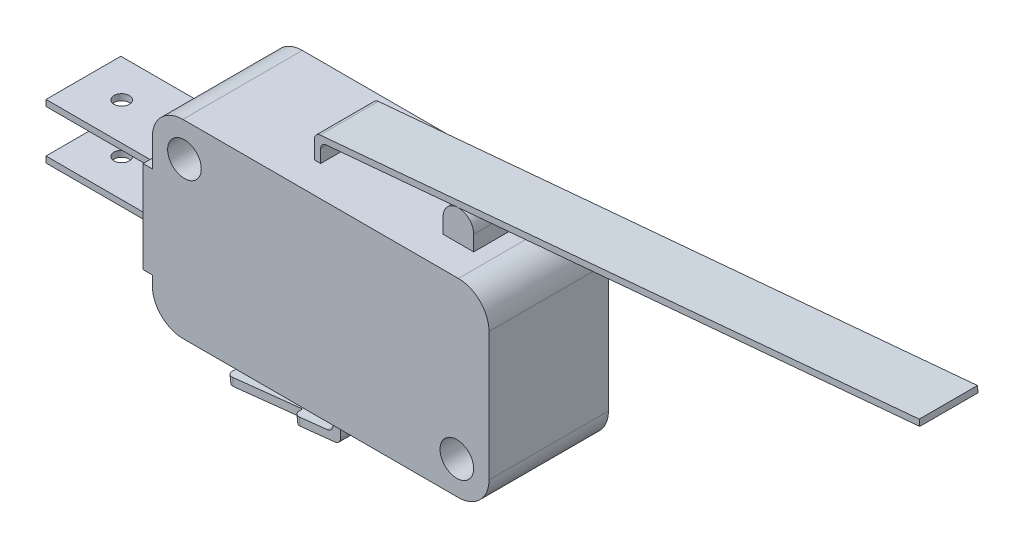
from build123d import *

# Parameters (mm, degrees)
SKETCH1_R      = 1.395
EXTRUDE1_DEPTH = 4.955
SKETCH2_W      = 9.906
SKETCH2_H      = 0.508
EXTRUDE2_DEPTH = 3.105
EXTRUDE3_DEPTH = 2.415
EXTRUDE4_DEPTH = 2.92
EXTRUDE5_REACH = 54.668
SKETCH5_W      = 6.351205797
SKETCH5_H      = 0.762
SKETCH5_H_2    = 0.76
EXTRUDE6_REACH = 54.668
FILLET1_R      = 0.508
EXTRUDE7_REACH = 52.435
SKETCH6_R      = 0.635
SKETCH_2_R     = 1.395
EXTRUDE8_DEPTH = 7.92


with BuildPart() as part:
    # Sketch1 → Extrude1 (new, symmetric)
    # profile 1 of 3: a face of its own
    with BuildSketch(Plane.XY):
        with BuildLine():
            Line((13.97, -5.334), (13.97, 5.334))
            ThreePointArc((13.97, 5.334), (13.226051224, 7.130051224), (11.43, 7.874))
            Line((11.43, 7.874), (-11.43, 7.874))
            ThreePointArc((-11.43, 7.874), (-13.226051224, 7.130051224), (-13.97, 5.334))
            Line((-13.97, 5.334), (-13.97, 3.048))
            Line((-13.97, 3.048), (-14.732, 3.048))
            Line((-14.732, 3.048), (-14.732, -4.572))
            Line((-14.732, -4.572), (-13.97, -4.572))
            Line((-13.97, -4.572), (-13.97, -5.334))
            ThreePointArc((-13.97, -5.334), (-13.226051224, -7.130051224), (-11.43, -7.874))
            Line((-11.43, -7.874), (11.43, -7.874))
            ThreePointArc((11.43, -7.874), (13.226051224, -7.130051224), (13.97, -5.334))
        make_face()
        with Locations((11.3, -5.16)):
            Circle(SKETCH1_R, mode=Mode.SUBTRACT)
        with Locations((-11.3, 5.08)):
            Circle(SKETCH1_R, mode=Mode.SUBTRACT)
    # profile 2 of 3: a face of its own
    with BuildSketch(Plane.XY):
        with Locations((-11.3, 5.08)):
            Circle(SKETCH1_R)
    # profile 3 of 3: a face of its own
    with BuildSketch(Plane.XY):
        with Locations((11.3, -5.16)):
            Circle(SKETCH1_R)
    extrude(amount=EXTRUDE1_DEPTH, both=True)

    # Sketch2 → Extrude2 (add, symmetric)
    with BuildSketch(Plane.XY):
        with Locations((-19.685, -2.54)):
            Rectangle(SKETCH2_W, SKETCH2_H)
        with Locations((-19.685, 1.524)):
            Rectangle(SKETCH2_W, SKETCH2_H)
    extrude(amount=EXTRUDE2_DEPTH, both=True)

    # Sketch3 → Extrude3 (add, symmetric)
    with BuildSketch(Plane.XY):
        Polygon((47.128347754, 14.344963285), (-3.048, 9.862642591), (-3.048, 7.874), (-2.54, 7.874), (-2.54, 9.398), (47.173548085, 13.838978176), align=None)
        with BuildLine():
            Line((10.16, 7.874), (10.16, 9.139))
            ThreePointArc((10.16, 9.139), (8.89, 10.409), (7.62, 9.139))
            Line((7.62, 9.139), (7.62, 7.874))
            Line((7.62, 7.874), (10.16, 7.874))
        make_face()
    extrude(amount=EXTRUDE3_DEPTH, both=True)

    # Sketch4 → Extrude4 (add, symmetric)
    with BuildSketch(Plane.XY):
        Polygon((-0.38, -10.984), (-0.38, -7.874), (-1.015, -7.874), (-1.015, -10.414), (-10.612457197, -11.452431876), (-10.54414973, -12.083747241), align=None)
    extrude(amount=EXTRUDE4_DEPTH, both=True)

    # Sketch5 → Extrude5 (cut, up to next)
    with BuildSketch(Plane(origin=(1.170304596, -10.816259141, 0), x_dir=(0.9941974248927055, 0.10757081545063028, 0), z_dir=(0.10757081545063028, -0.9941974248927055, 0)), mode=Mode.PRIVATE) as extrude5_sk1:
        with Locations((-8.607222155, 2.539)):
            Rectangle(SKETCH5_W, SKETCH5_H)
    extrude5_tool1 = extrude(extrude5_sk1.sketch, amount=-EXTRUDE5_REACH, mode=Mode.PRIVATE) & part.part
    # Sketch5 → Extrude5 (cut, up to next)
    with BuildSketch(Plane(origin=(1.170304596, -10.816259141, 0), x_dir=(0.9941974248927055, 0.10757081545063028, 0), z_dir=(0.10757081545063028, -0.9941974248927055, 0)), mode=Mode.PRIVATE) as extrude5_sk2:
        with Locations((-8.607222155, -2.54)):
            Rectangle(SKETCH5_W, SKETCH5_H_2)
    extrude5_tool2 = extrude(extrude5_sk2.sketch, amount=-EXTRUDE5_REACH, mode=Mode.PRIVATE) & part.part
    add(extrude5_tool1.solids().sort_by_distance((-7.386974, -11.742145, 2.539))[0], mode=Mode.SUBTRACT)
    add(extrude5_tool2.solids().sort_by_distance((-7.386974, -11.742145, -2.54))[0], mode=Mode.SUBTRACT)

    # Sketch → Extrude6 (cut, up to next)
    with BuildSketch(Plane(origin=(1.170304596, -10.816259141, 0), x_dir=(0.9941974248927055, 0.10757081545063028, 0), z_dir=(0.10757081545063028, -0.9941974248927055, 0)), mode=Mode.PRIVATE) as extrude6_sk1:
        with BuildLine():
            ThreePointArc((-8.863824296, 0), (-8.101824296, -0.762), (-7.339824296, 0))
            Line((-7.339824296, 0), (-8.863824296, 0))
        make_face()
    extrude6_tool1 = extrude(extrude6_sk1.sketch, amount=-EXTRUDE6_REACH, mode=Mode.PRIVATE) & part.part
    # Sketch → Extrude6 (cut, up to next)
    with BuildSketch(Plane(origin=(1.170304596, -10.816259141, 0), x_dir=(0.9941974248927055, 0.10757081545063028, 0), z_dir=(0.10757081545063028, -0.9941974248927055, 0)), mode=Mode.PRIVATE) as extrude6_sk2:
        with BuildLine():
            Line((-8.863824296, 0), (-7.339824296, 0))
            ThreePointArc((-7.339824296, 0), (-8.101824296, 0.762), (-8.863824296, 0))
        make_face()
    extrude6_tool2 = extrude(extrude6_sk2.sketch, amount=-EXTRUDE6_REACH, mode=Mode.PRIVATE) & part.part
    # Sketch → Extrude6 (cut, up to next)
    with BuildSketch(Plane(origin=(1.170304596, -10.816259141, 0), x_dir=(0.9941974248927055, 0.10757081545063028, 0), z_dir=(0.10757081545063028, -0.9941974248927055, 0)), mode=Mode.PRIVATE) as extrude6_sk3:
        with BuildLine():
            ThreePointArc((-8.863824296, 0), (-8.101824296, -0.762), (-7.339824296, 0))
            Line((-7.339824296, 0), (-8.863824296, 0))
        make_face()
    extrude6_tool3 = extrude(extrude6_sk3.sketch, amount=-EXTRUDE6_REACH, mode=Mode.PRIVATE) & part.part
    # Sketch → Extrude6 (cut, up to next)
    with BuildSketch(Plane(origin=(1.170304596, -10.816259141, 0), x_dir=(0.9941974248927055, 0.10757081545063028, 0), z_dir=(0.10757081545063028, -0.9941974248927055, 0)), mode=Mode.PRIVATE) as extrude6_sk4:
        with BuildLine():
            Line((-8.863824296, 0), (-7.339824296, 0))
            ThreePointArc((-7.339824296, 0), (-8.101824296, 0.762), (-8.863824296, 0))
        make_face()
    extrude6_tool4 = extrude(extrude6_sk4.sketch, amount=-EXTRUDE6_REACH, mode=Mode.PRIVATE) & part.part
    add(extrude6_tool1.solids().sort_by_distance((-6.884508, -11.687779, -0.323403))[0], mode=Mode.SUBTRACT)
    add(extrude6_tool2.solids().sort_by_distance((-6.884508, -11.687779, 0.323403))[0], mode=Mode.SUBTRACT)
    add(extrude6_tool3.solids().sort_by_distance((-6.884508, -11.687779, -0.323403))[0], mode=Mode.SUBTRACT)
    add(extrude6_tool4.solids().sort_by_distance((-6.884508, -11.687779, 0.323403))[0], mode=Mode.SUBTRACT)

    # Fillet1
    fillet1_edges = [part.edges().sort_by_distance(p)[0] for p in [
        (-4.263951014, -11.084885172, 2.92),
        (-10.578303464, -11.768089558, 2.158),
        (-10.578303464, -11.768089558, -2.16),
        (-4.263951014, -11.084885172, -2.92),
        (-3.048, 9.862642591, 0),
        (-2.54, 9.398, 0),
        (-0.38, -10.984, 0),
        (-1.015, -10.414, 0),
    ]]
    fillet(fillet1_edges, radius=FILLET1_R)

    # Extrude7: up to this face of the body (flat: up to its plane)
    extrude7_end = Plane(part.part.faces().sort_by_distance((-19.685, 1.778, 0))[0])
    # Sketch6 → Extrude7 (cut, up to the picked face)
    with BuildSketch(Plane.XZ.offset(2.794), mode=Mode.PRIVATE) as extrude7_sk1:
        with Locations((-21.462, 0)):
            Circle(SKETCH6_R)
    extrude7_tool1 = split(extrude(extrude7_sk1.sketch, amount=-EXTRUDE7_REACH, mode=Mode.PRIVATE), bisect_by=extrude7_end, keep=Keep.BOTH, mode=Mode.PRIVATE)
    add(extrude7_tool1.solids().sort_by(Axis((-21.462, -2.794, 0), (0, 1, 0)))[0], mode=Mode.SUBTRACT)

    # Sketch 2 → Extrude8 (cut, symmetric)
    with BuildSketch(Plane.XY):
        with Locations((-11.3, 5.08)):
            Circle(SKETCH_2_R)
        with Locations((11.3, -5.16)):
            Circle(SKETCH_2_R)
    extrude(amount=EXTRUDE8_DEPTH, both=True, mode=Mode.SUBTRACT)


solid = part.part
